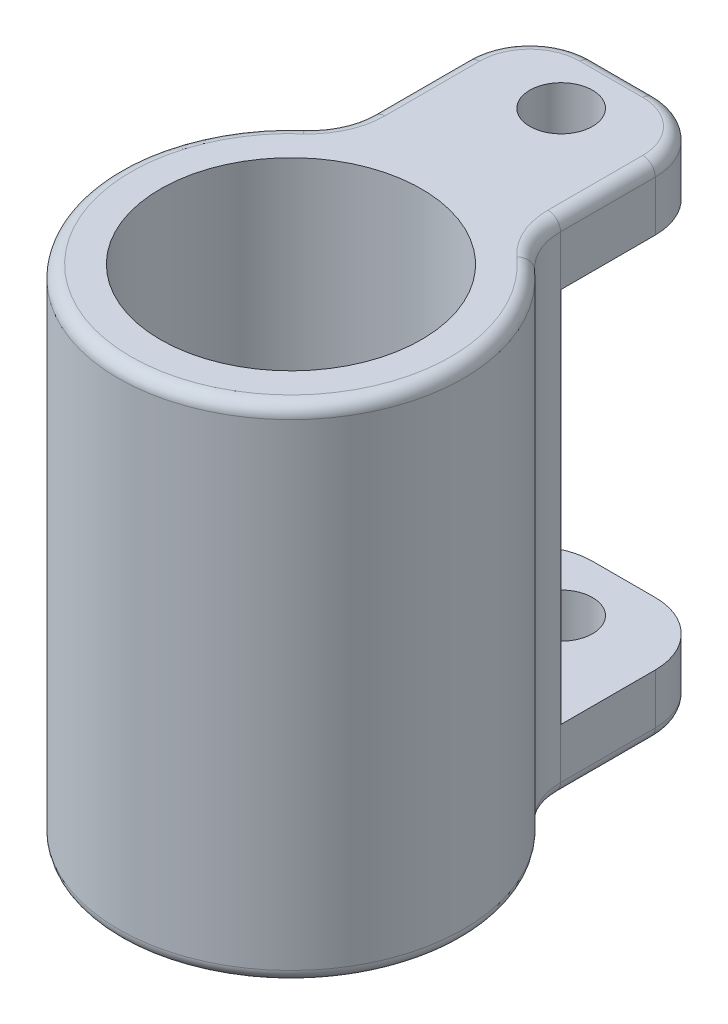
ISO-10303-21;
HEADER;
FILE_DESCRIPTION(('STEP AP214'),'2;1');
FILE_NAME('part.step','',(''),(''),'','','');
FILE_SCHEMA(('AUTOMOTIVE_DESIGN { 1 0 10303 214 1 1 1 1 }'));
ENDSEC;
DATA;
#1=APPLICATION_CONTEXT('core data for automotive mechanical design processes');
#2=APPLICATION_PROTOCOL_DEFINITION('international standard','automotive_design',2000,#1);
#3=PRODUCT_CONTEXT('',#1,'mechanical');
#4=PRODUCT('Part','Part','',(#3));
#5=PRODUCT_RELATED_PRODUCT_CATEGORY('part','',(#4));
#6=PRODUCT_DEFINITION_FORMATION('','',#4);
#7=PRODUCT_DEFINITION_CONTEXT('part definition',#1,'design');
#8=PRODUCT_DEFINITION('design','',#6,#7);
#9=PRODUCT_DEFINITION_SHAPE('','',#8);
#10=(LENGTH_UNIT() NAMED_UNIT(*) SI_UNIT(.MILLI.,.METRE.));
#11=(NAMED_UNIT(*) PLANE_ANGLE_UNIT() SI_UNIT($,.RADIAN.));
#12=(NAMED_UNIT(*) SI_UNIT($,.STERADIAN.) SOLID_ANGLE_UNIT());
#13=UNCERTAINTY_MEASURE_WITH_UNIT(LENGTH_MEASURE(1.E-05),#10,'distance_accuracy_value','');
#14=(GEOMETRIC_REPRESENTATION_CONTEXT(3) GLOBAL_UNCERTAINTY_ASSIGNED_CONTEXT((#13)) GLOBAL_UNIT_ASSIGNED_CONTEXT((#10,
#11,#12)) REPRESENTATION_CONTEXT('',''));
#15=CARTESIAN_POINT('',(0.,0.,0.));
#16=DIRECTION('',(0.,0.,1.));
#17=DIRECTION('',(1.,0.,0.));
#18=AXIS2_PLACEMENT_3D('',#15,#16,#17);
#19=CARTESIAN_POINT('',(1.5875,25.4,-13.6680134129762));
#20=DIRECTION('',(0.,-1.,0.));
#21=DIRECTION('',(0.,0.,-1.));
#22=AXIS2_PLACEMENT_3D('',#19,#20,#21);
#23=CYLINDRICAL_SURFACE('',#22,3.175);
#24=DIRECTION('',(0.,-1.,0.));
#25=VECTOR('',#24,1.);
#26=CARTESIAN_POINT('',(4.7625,25.4,-13.6680134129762));
#27=LINE('',#26,#25);
#28=CARTESIAN_POINT('',(4.7625,3.175,-13.6680134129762));
#29=VERTEX_POINT('',#28);
#30=CARTESIAN_POINT('',(4.7625,0.635,-13.6680134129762));
#31=VERTEX_POINT('',#30);
#32=EDGE_CURVE('E250',#29,#31,#27,.T.);
#33=ORIENTED_EDGE('',*,*,#32,.T.);
#34=CARTESIAN_POINT('',(1.5875,0.635,-13.6680134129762));
#35=DIRECTION('',(0.,1.,0.));
#36=DIRECTION('',(0.,0.,1.));
#37=AXIS2_PLACEMENT_3D('',#34,#35,#36);
#38=CIRCLE('',#37,3.175);
#39=CARTESIAN_POINT('',(1.58749999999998,0.635,-16.8430134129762));
#40=VERTEX_POINT('',#39);
#41=EDGE_CURVE('E304',#31,#40,#38,.T.);
#42=ORIENTED_EDGE('',*,*,#41,.T.);
#43=DIRECTION('',(0.,-1.,0.));
#44=VECTOR('',#43,1.);
#45=CARTESIAN_POINT('',(1.58749999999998,25.4,-16.8430134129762));
#46=LINE('',#45,#44);
#47=CARTESIAN_POINT('',(1.58749999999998,3.175,-16.8430134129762));
#48=VERTEX_POINT('',#47);
#49=EDGE_CURVE('E196',#48,#40,#46,.T.);
#50=ORIENTED_EDGE('',*,*,#49,.F.);
#51=CARTESIAN_POINT('',(1.5875,3.175,-13.6680134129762));
#52=DIRECTION('',(0.,-1.,0.));
#53=DIRECTION('',(0.,0.,-1.));
#54=AXIS2_PLACEMENT_3D('',#51,#52,#53);
#55=CIRCLE('',#54,3.175);
#56=EDGE_CURVE('E214',#29,#48,#55,.F.);
#57=ORIENTED_EDGE('',*,*,#56,.F.);
#58=EDGE_LOOP('',(#33,#42,#50,#57));
#59=FACE_BOUND('',#58,.T.);
#60=ADVANCED_FACE('F35',(#59),#23,.T.);
#61=CARTESIAN_POINT('',(1.58749999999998,25.4,-16.8430134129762));
#62=DIRECTION('',(0.,0.,1.));
#63=DIRECTION('',(1.,0.,0.));
#64=AXIS2_PLACEMENT_3D('',#61,#62,#63);
#65=PLANE('',#64);
#66=ORIENTED_EDGE('',*,*,#49,.T.);
#67=DIRECTION('',(-1.,0.,0.));
#68=VECTOR('',#67,1.);
#69=CARTESIAN_POINT('',(1.58749999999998,0.635,-16.8430134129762));
#70=LINE('',#69,#68);
#71=CARTESIAN_POINT('',(-1.58749999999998,0.635,-16.8430134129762));
#72=VERTEX_POINT('',#71);
#73=EDGE_CURVE('E302',#40,#72,#70,.T.);
#74=ORIENTED_EDGE('',*,*,#73,.T.);
#75=DIRECTION('',(0.,-1.,0.));
#76=VECTOR('',#75,1.);
#77=CARTESIAN_POINT('',(-1.58749999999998,25.4,-16.8430134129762));
#78=LINE('',#77,#76);
#79=CARTESIAN_POINT('',(-1.5875,3.175,-16.8430134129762));
#80=VERTEX_POINT('',#79);
#81=EDGE_CURVE('E257',#80,#72,#78,.T.);
#82=ORIENTED_EDGE('',*,*,#81,.F.);
#83=DIRECTION('',(1.,0.,0.));
#84=VECTOR('',#83,1.);
#85=CARTESIAN_POINT('',(-8.73225,3.175,-16.8430134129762));
#86=LINE('',#85,#84);
#87=EDGE_CURVE('E237',#80,#48,#86,.T.);
#88=ORIENTED_EDGE('',*,*,#87,.T.);
#89=EDGE_LOOP('',(#66,#74,#82,#88));
#90=FACE_BOUND('',#89,.T.);
#91=ADVANCED_FACE('F453',(#90),#65,.F.);
#92=CARTESIAN_POINT('',(-1.5875,25.4,-13.6680134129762));
#93=DIRECTION('',(0.,-1.,0.));
#94=DIRECTION('',(0.,0.,-1.));
#95=AXIS2_PLACEMENT_3D('',#92,#93,#94);
#96=CYLINDRICAL_SURFACE('',#95,3.175);
#97=ORIENTED_EDGE('',*,*,#81,.T.);
#98=CARTESIAN_POINT('',(-1.5875,0.635,-13.6680134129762));
#99=DIRECTION('',(0.,1.,0.));
#100=DIRECTION('',(0.,0.,1.));
#101=AXIS2_PLACEMENT_3D('',#98,#99,#100);
#102=CIRCLE('',#101,3.175);
#103=CARTESIAN_POINT('',(-4.7625,0.635,-13.6680134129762));
#104=VERTEX_POINT('',#103);
#105=EDGE_CURVE('E300',#72,#104,#102,.T.);
#106=ORIENTED_EDGE('',*,*,#105,.T.);
#107=DIRECTION('',(0.,-1.,0.));
#108=VECTOR('',#107,1.);
#109=CARTESIAN_POINT('',(-4.7625,25.4,-13.6680134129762));
#110=LINE('',#109,#108);
#111=CARTESIAN_POINT('',(-4.7625,3.175,-13.6680134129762));
#112=VERTEX_POINT('',#111);
#113=EDGE_CURVE('E254',#112,#104,#110,.T.);
#114=ORIENTED_EDGE('',*,*,#113,.F.);
#115=CARTESIAN_POINT('',(-1.5875,3.175,-13.6680134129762));
#116=DIRECTION('',(0.,-1.,0.));
#117=DIRECTION('',(0.,0.,-1.));
#118=AXIS2_PLACEMENT_3D('',#115,#116,#117);
#119=CIRCLE('',#118,3.175);
#120=EDGE_CURVE('E229',#80,#112,#119,.F.);
#121=ORIENTED_EDGE('',*,*,#120,.F.);
#122=EDGE_LOOP('',(#97,#106,#114,#121));
#123=FACE_BOUND('',#122,.T.);
#124=ADVANCED_FACE('F456',(#123),#96,.T.);
#125=CARTESIAN_POINT('',(1.5875,25.4,-13.6680134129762));
#126=DIRECTION('',(0.,1.,0.));
#127=DIRECTION('',(0.,0.,1.));
#128=AXIS2_PLACEMENT_3D('',#125,#126,#127);
#129=PLANE('',#128);
#130=CARTESIAN_POINT('',(1.5875,25.4,-13.6680134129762));
#131=DIRECTION('',(0.,1.,0.));
#132=DIRECTION('',(0.,0.,1.));
#133=AXIS2_PLACEMENT_3D('',#130,#131,#132);
#134=CIRCLE('',#133,2.54);
#135=CARTESIAN_POINT('',(4.1275,25.4,-13.6680134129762));
#136=VERTEX_POINT('',#135);
#137=CARTESIAN_POINT('',(1.58749999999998,25.4,-16.2080134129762));
#138=VERTEX_POINT('',#137);
#139=EDGE_CURVE('E326',#136,#138,#134,.T.);
#140=ORIENTED_EDGE('',*,*,#139,.T.);
#141=DIRECTION('',(-1.,0.,0.));
#142=VECTOR('',#141,1.);
#143=CARTESIAN_POINT('',(-1.58749999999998,25.4,-16.2080134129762));
#144=LINE('',#143,#142);
#145=CARTESIAN_POINT('',(-1.58749999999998,25.4,-16.2080134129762));
#146=VERTEX_POINT('',#145);
#147=EDGE_CURVE('E328',#138,#146,#144,.T.);
#148=ORIENTED_EDGE('',*,*,#147,.T.);
#149=CARTESIAN_POINT('',(-1.5875,25.4,-13.6680134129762));
#150=DIRECTION('',(0.,1.,0.));
#151=DIRECTION('',(0.,0.,1.));
#152=AXIS2_PLACEMENT_3D('',#149,#150,#151);
#153=CIRCLE('',#152,2.54);
#154=CARTESIAN_POINT('',(-4.1275,25.4,-13.6680134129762));
#155=VERTEX_POINT('',#154);
#156=EDGE_CURVE('E314',#146,#155,#153,.T.);
#157=ORIENTED_EDGE('',*,*,#156,.T.);
#158=DIRECTION('',(0.,0.,1.));
#159=VECTOR('',#158,1.);
#160=CARTESIAN_POINT('',(-4.1275,25.4,-8.87439478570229));
#161=LINE('',#160,#159);
#162=CARTESIAN_POINT('',(-4.1275,25.4,-8.87439478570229));
#163=VERTEX_POINT('',#162);
#164=EDGE_CURVE('E316',#155,#163,#161,.T.);
#165=ORIENTED_EDGE('',*,*,#164,.T.);
#166=CARTESIAN_POINT('',(-7.9375,25.4,-8.87439478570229));
#167=DIRECTION('',(0.,1.,0.));
#168=DIRECTION('',(0.,0.,1.));
#169=AXIS2_PLACEMENT_3D('',#166,#167,#168);
#170=CIRCLE('',#169,3.81);
#171=CARTESIAN_POINT('',(-5.3975,25.4,-6.03458845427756));
#172=VERTEX_POINT('',#171);
#173=EDGE_CURVE('E318',#163,#172,#170,.F.);
#174=ORIENTED_EDGE('',*,*,#173,.T.);
#175=CARTESIAN_POINT('',(0.,25.4,0.));
#176=DIRECTION('',(0.,1.,0.));
#177=DIRECTION('',(0.,0.,1.));
#178=AXIS2_PLACEMENT_3D('',#175,#176,#177);
#179=CIRCLE('',#178,8.09625);
#180=CARTESIAN_POINT('',(5.3975,25.4,-6.03458845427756));
#181=VERTEX_POINT('',#180);
#182=EDGE_CURVE('E320',#172,#181,#179,.T.);
#183=ORIENTED_EDGE('',*,*,#182,.T.);
#184=CARTESIAN_POINT('',(7.9375,25.4,-8.87439478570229));
#185=DIRECTION('',(0.,1.,0.));
#186=DIRECTION('',(0.,0.,1.));
#187=AXIS2_PLACEMENT_3D('',#184,#185,#186);
#188=CIRCLE('',#187,3.81);
#189=CARTESIAN_POINT('',(4.1275,25.4,-8.87439478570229));
#190=VERTEX_POINT('',#189);
#191=EDGE_CURVE('E322',#181,#190,#188,.F.);
#192=ORIENTED_EDGE('',*,*,#191,.T.);
#193=DIRECTION('',(0.,0.,-1.));
#194=VECTOR('',#193,1.);
#195=CARTESIAN_POINT('',(4.1275,25.4,-13.6680134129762));
#196=LINE('',#195,#194);
#197=EDGE_CURVE('E324',#190,#136,#196,.T.);
#198=ORIENTED_EDGE('',*,*,#197,.T.);
#199=EDGE_LOOP('',(#140,#148,#157,#165,#174,#183,#192,#198));
#200=FACE_BOUND('',#199,.T.);
#201=CARTESIAN_POINT('',(0.,25.4,-13.6680134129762));
#202=DIRECTION('',(0.,1.,0.));
#203=DIRECTION('',(0.,0.,1.));
#204=AXIS2_PLACEMENT_3D('',#201,#202,#203);
#205=CIRCLE('',#204,1.5875);
#206=CARTESIAN_POINT('',(0.,25.4,-12.0805134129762));
#207=VERTEX_POINT('',#206);
#208=EDGE_CURVE('E359',#207,#207,#205,.T.);
#209=ORIENTED_EDGE('',*,*,#208,.F.);
#210=EDGE_LOOP('',(#209));
#211=FACE_BOUND('',#210,.T.);
#212=CARTESIAN_POINT('',(0.,25.4,0.));
#213=DIRECTION('',(0.,1.,0.));
#214=DIRECTION('',(0.,0.,1.));
#215=AXIS2_PLACEMENT_3D('',#212,#213,#214);
#216=CIRCLE('',#215,6.604);
#217=CARTESIAN_POINT('',(0.,25.4,6.604));
#218=VERTEX_POINT('',#217);
#219=EDGE_CURVE('E247',#218,#218,#216,.T.);
#220=ORIENTED_EDGE('',*,*,#219,.F.);
#221=EDGE_LOOP('',(#220));
#222=FACE_BOUND('',#221,.T.);
#223=ADVANCED_FACE('F479',(#200,#211,#222),#129,.T.);
#224=CARTESIAN_POINT('',(1.5875,0.,-13.6680134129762));
#225=DIRECTION('',(0.,1.,0.));
#226=DIRECTION('',(0.,0.,1.));
#227=AXIS2_PLACEMENT_3D('',#224,#225,#226);
#228=PLANE('',#227);
#229=CARTESIAN_POINT('',(0.,0.,0.));
#230=DIRECTION('',(0.,1.,0.));
#231=DIRECTION('',(0.,0.,1.));
#232=AXIS2_PLACEMENT_3D('',#229,#230,#231);
#233=CIRCLE('',#232,8.09625);
#234=CARTESIAN_POINT('',(5.3975,0.,-6.03458845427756));
#235=VERTEX_POINT('',#234);
#236=CARTESIAN_POINT('',(-5.3975,0.,-6.03458845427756));
#237=VERTEX_POINT('',#236);
#238=EDGE_CURVE('E271',#235,#237,#233,.F.);
#239=ORIENTED_EDGE('',*,*,#238,.T.);
#240=CARTESIAN_POINT('',(-7.9375,0.,-8.87439478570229));
#241=DIRECTION('',(0.,1.,0.));
#242=DIRECTION('',(0.,0.,1.));
#243=AXIS2_PLACEMENT_3D('',#240,#241,#242);
#244=CIRCLE('',#243,3.81);
#245=CARTESIAN_POINT('',(-4.1275,0.,-8.87439478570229));
#246=VERTEX_POINT('',#245);
#247=EDGE_CURVE('E288',#237,#246,#244,.T.);
#248=ORIENTED_EDGE('',*,*,#247,.T.);
#249=DIRECTION('',(0.,0.,1.));
#250=VECTOR('',#249,1.);
#251=CARTESIAN_POINT('',(-4.1275,0.,-13.6680134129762));
#252=LINE('',#251,#250);
#253=CARTESIAN_POINT('',(-4.1275,0.,-13.6680134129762));
#254=VERTEX_POINT('',#253);
#255=EDGE_CURVE('E286',#246,#254,#252,.F.);
#256=ORIENTED_EDGE('',*,*,#255,.T.);
#257=CARTESIAN_POINT('',(-1.5875,0.,-13.6680134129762));
#258=DIRECTION('',(0.,1.,0.));
#259=DIRECTION('',(0.,0.,1.));
#260=AXIS2_PLACEMENT_3D('',#257,#258,#259);
#261=CIRCLE('',#260,2.54);
#262=CARTESIAN_POINT('',(-1.58749999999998,0.,-16.2080134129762));
#263=VERTEX_POINT('',#262);
#264=EDGE_CURVE('E284',#254,#263,#261,.F.);
#265=ORIENTED_EDGE('',*,*,#264,.T.);
#266=DIRECTION('',(-1.,0.,0.));
#267=VECTOR('',#266,1.);
#268=CARTESIAN_POINT('',(1.5875,0.,-16.2080134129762));
#269=LINE('',#268,#267);
#270=CARTESIAN_POINT('',(1.58749999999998,0.,-16.2080134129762));
#271=VERTEX_POINT('',#270);
#272=EDGE_CURVE('E282',#263,#271,#269,.F.);
#273=ORIENTED_EDGE('',*,*,#272,.T.);
#274=CARTESIAN_POINT('',(1.5875,0.,-13.6680134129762));
#275=DIRECTION('',(0.,1.,0.));
#276=DIRECTION('',(0.,0.,1.));
#277=AXIS2_PLACEMENT_3D('',#274,#275,#276);
#278=CIRCLE('',#277,2.54);
#279=CARTESIAN_POINT('',(4.1275,0.,-13.6680134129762));
#280=VERTEX_POINT('',#279);
#281=EDGE_CURVE('E280',#271,#280,#278,.F.);
#282=ORIENTED_EDGE('',*,*,#281,.T.);
#283=DIRECTION('',(0.,0.,-1.));
#284=VECTOR('',#283,1.);
#285=CARTESIAN_POINT('',(4.1275,0.,-13.6680134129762));
#286=LINE('',#285,#284);
#287=CARTESIAN_POINT('',(4.1275,0.,-8.87439478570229));
#288=VERTEX_POINT('',#287);
#289=EDGE_CURVE('E278',#280,#288,#286,.F.);
#290=ORIENTED_EDGE('',*,*,#289,.T.);
#291=CARTESIAN_POINT('',(7.9375,0.,-8.87439478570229));
#292=DIRECTION('',(0.,1.,0.));
#293=DIRECTION('',(0.,0.,1.));
#294=AXIS2_PLACEMENT_3D('',#291,#292,#293);
#295=CIRCLE('',#294,3.81);
#296=EDGE_CURVE('E276',#288,#235,#295,.T.);
#297=ORIENTED_EDGE('',*,*,#296,.T.);
#298=EDGE_LOOP('',(#239,#248,#256,#265,#273,#282,#290,#297));
#299=FACE_BOUND('',#298,.T.);
#300=CARTESIAN_POINT('',(0.,0.,-13.6680134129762));
#301=DIRECTION('',(0.,1.,0.));
#302=DIRECTION('',(0.,0.,1.));
#303=AXIS2_PLACEMENT_3D('',#300,#301,#302);
#304=CIRCLE('',#303,1.5875);
#305=CARTESIAN_POINT('',(0.,0.,-12.0805134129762));
#306=VERTEX_POINT('',#305);
#307=EDGE_CURVE('E274',#306,#306,#304,.T.);
#308=ORIENTED_EDGE('',*,*,#307,.T.);
#309=EDGE_LOOP('',(#308));
#310=FACE_BOUND('',#309,.T.);
#311=CARTESIAN_POINT('',(0.,0.,0.));
#312=DIRECTION('',(0.,1.,0.));
#313=DIRECTION('',(0.,0.,1.));
#314=AXIS2_PLACEMENT_3D('',#311,#312,#313);
#315=CIRCLE('',#314,6.604);
#316=CARTESIAN_POINT('',(0.,0.,6.604));
#317=VERTEX_POINT('',#316);
#318=EDGE_CURVE('E246',#317,#317,#315,.T.);
#319=ORIENTED_EDGE('',*,*,#318,.T.);
#320=EDGE_LOOP('',(#319));
#321=FACE_BOUND('',#320,.T.);
#322=ADVANCED_FACE('F411',(#299,#310,#321),#228,.F.);
#323=CARTESIAN_POINT('',(1.58749999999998,24.765,-16.8430134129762));
#324=VERTEX_POINT('',#323);
#325=CARTESIAN_POINT('',(1.58749999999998,22.225,-16.8430134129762));
#326=VERTEX_POINT('',#325);
#327=EDGE_CURVE('E188',#324,#326,#46,.T.);
#328=ORIENTED_EDGE('',*,*,#327,.F.);
#329=CARTESIAN_POINT('',(1.5875,24.765,-13.6680134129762));
#330=DIRECTION('',(0.,1.,0.));
#331=DIRECTION('',(0.,0.,1.));
#332=AXIS2_PLACEMENT_3D('',#329,#330,#331);
#333=CIRCLE('',#332,3.175);
#334=CARTESIAN_POINT('',(4.7625,24.765,-13.6680134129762));
#335=VERTEX_POINT('',#334);
#336=EDGE_CURVE('E332',#324,#335,#333,.F.);
#337=ORIENTED_EDGE('',*,*,#336,.T.);
#338=CARTESIAN_POINT('',(4.7625,22.225,-13.6680134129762));
#339=VERTEX_POINT('',#338);
#340=EDGE_CURVE('E213',#335,#339,#27,.T.);
#341=ORIENTED_EDGE('',*,*,#340,.T.);
#342=CARTESIAN_POINT('',(1.5875,22.225,-13.6680134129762));
#343=DIRECTION('',(0.,1.,0.));
#344=DIRECTION('',(0.,0.,1.));
#345=AXIS2_PLACEMENT_3D('',#342,#343,#344);
#346=CIRCLE('',#345,3.175);
#347=EDGE_CURVE('E203',#326,#339,#346,.F.);
#348=ORIENTED_EDGE('',*,*,#347,.F.);
#349=EDGE_LOOP('',(#328,#337,#341,#348));
#350=FACE_BOUND('',#349,.T.);
#351=ADVANCED_FACE('F211',(#350),#23,.T.);
#352=CARTESIAN_POINT('',(-1.58749999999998,24.765,-16.8430134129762));
#353=VERTEX_POINT('',#352);
#354=CARTESIAN_POINT('',(-1.5875,22.225,-16.8430134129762));
#355=VERTEX_POINT('',#354);
#356=EDGE_CURVE('E258',#353,#355,#78,.T.);
#357=ORIENTED_EDGE('',*,*,#356,.F.);
#358=DIRECTION('',(-1.,0.,0.));
#359=VECTOR('',#358,1.);
#360=CARTESIAN_POINT('',(1.58749999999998,24.765,-16.8430134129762));
#361=LINE('',#360,#359);
#362=EDGE_CURVE('E192',#353,#324,#361,.F.);
#363=ORIENTED_EDGE('',*,*,#362,.T.);
#364=ORIENTED_EDGE('',*,*,#327,.T.);
#365=DIRECTION('',(1.,0.,0.));
#366=VECTOR('',#365,1.);
#367=CARTESIAN_POINT('',(-8.73225,22.225,-16.8430134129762));
#368=LINE('',#367,#366);
#369=EDGE_CURVE('E191',#355,#326,#368,.T.);
#370=ORIENTED_EDGE('',*,*,#369,.F.);
#371=EDGE_LOOP('',(#357,#363,#364,#370));
#372=FACE_BOUND('',#371,.T.);
#373=ADVANCED_FACE('F190',(#372),#65,.F.);
#374=CARTESIAN_POINT('',(-4.7625,24.765,-13.6680134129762));
#375=VERTEX_POINT('',#374);
#376=CARTESIAN_POINT('',(-4.7625,22.225,-13.6680134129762));
#377=VERTEX_POINT('',#376);
#378=EDGE_CURVE('E255',#375,#377,#110,.T.);
#379=ORIENTED_EDGE('',*,*,#378,.F.);
#380=CARTESIAN_POINT('',(-1.5875,24.765,-13.6680134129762));
#381=DIRECTION('',(0.,1.,0.));
#382=DIRECTION('',(0.,0.,1.));
#383=AXIS2_PLACEMENT_3D('',#380,#381,#382);
#384=CIRCLE('',#383,3.175);
#385=EDGE_CURVE('E11',#375,#353,#384,.F.);
#386=ORIENTED_EDGE('',*,*,#385,.T.);
#387=ORIENTED_EDGE('',*,*,#356,.T.);
#388=CARTESIAN_POINT('',(-1.5875,22.225,-13.6680134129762));
#389=DIRECTION('',(0.,1.,0.));
#390=DIRECTION('',(0.,0.,1.));
#391=AXIS2_PLACEMENT_3D('',#388,#389,#390);
#392=CIRCLE('',#391,3.175);
#393=EDGE_CURVE('E207',#377,#355,#392,.F.);
#394=ORIENTED_EDGE('',*,*,#393,.F.);
#395=EDGE_LOOP('',(#379,#386,#387,#394));
#396=FACE_BOUND('',#395,.T.);
#397=ADVANCED_FACE('F470',(#396),#96,.T.);
#398=CARTESIAN_POINT('',(-4.7625,25.4,-7.31801341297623));
#399=DIRECTION('',(1.,0.,0.));
#400=DIRECTION('',(0.,0.,-1.));
#401=AXIS2_PLACEMENT_3D('',#398,#399,#400);
#402=PLANE('',#401);
#403=ORIENTED_EDGE('',*,*,#113,.T.);
#404=DIRECTION('',(0.,0.,1.));
#405=VECTOR('',#404,1.);
#406=CARTESIAN_POINT('',(-4.7625,0.635,-7.31801341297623));
#407=LINE('',#406,#405);
#408=CARTESIAN_POINT('',(-4.7625,0.635,-8.87439478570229));
#409=VERTEX_POINT('',#408);
#410=EDGE_CURVE('E298',#104,#409,#407,.T.);
#411=ORIENTED_EDGE('',*,*,#410,.T.);
#412=DIRECTION('',(0.,1.,0.));
#413=VECTOR('',#412,1.);
#414=CARTESIAN_POINT('',(-4.7625,25.4,-8.87439478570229));
#415=LINE('',#414,#413);
#416=CARTESIAN_POINT('',(-4.7625,24.765,-8.87439478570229));
#417=VERTEX_POINT('',#416);
#418=EDGE_CURVE('E268',#409,#417,#415,.T.);
#419=ORIENTED_EDGE('',*,*,#418,.T.);
#420=DIRECTION('',(0.,0.,1.));
#421=VECTOR('',#420,1.);
#422=CARTESIAN_POINT('',(-4.7625,24.765,-13.6680134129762));
#423=LINE('',#422,#421);
#424=EDGE_CURVE('E296',#417,#375,#423,.F.);
#425=ORIENTED_EDGE('',*,*,#424,.T.);
#426=ORIENTED_EDGE('',*,*,#378,.T.);
#427=DIRECTION('',(0.,0.,-1.));
#428=VECTOR('',#427,1.);
#429=CARTESIAN_POINT('',(-4.7625,22.225,-16.8430134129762));
#430=LINE('',#429,#428);
#431=CARTESIAN_POINT('',(-4.7625,22.225,-8.90551341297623));
#432=VERTEX_POINT('',#431);
#433=EDGE_CURVE('E240',#432,#377,#430,.T.);
#434=ORIENTED_EDGE('',*,*,#433,.F.);
#435=DIRECTION('',(0.,1.,0.));
#436=VECTOR('',#435,1.);
#437=CARTESIAN_POINT('',(-4.7625,22.225,-8.90551341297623));
#438=LINE('',#437,#436);
#439=CARTESIAN_POINT('',(-4.7625,3.175,-8.90551341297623));
#440=VERTEX_POINT('',#439);
#441=EDGE_CURVE('E217',#440,#432,#438,.T.);
#442=ORIENTED_EDGE('',*,*,#441,.F.);
#443=DIRECTION('',(0.,0.,1.));
#444=VECTOR('',#443,1.);
#445=CARTESIAN_POINT('',(-4.7625,3.175,-16.8430134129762));
#446=LINE('',#445,#444);
#447=EDGE_CURVE('E226',#112,#440,#446,.T.);
#448=ORIENTED_EDGE('',*,*,#447,.F.);
#449=EDGE_LOOP('',(#403,#411,#419,#425,#426,#434,#442,#448));
#450=FACE_BOUND('',#449,.T.);
#451=ADVANCED_FACE('F464',(#450),#402,.F.);
#452=CARTESIAN_POINT('',(0.,25.4,0.));
#453=DIRECTION('',(0.,-1.,0.));
#454=DIRECTION('',(0.,0.,-1.));
#455=AXIS2_PLACEMENT_3D('',#452,#453,#454);
#456=CYLINDRICAL_SURFACE('',#455,8.73125);
#457=DIRECTION('',(0.,-1.,0.));
#458=VECTOR('',#457,1.);
#459=CARTESIAN_POINT('',(5.82083333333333,25.4,-6.50788950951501));
#460=LINE('',#459,#458);
#461=CARTESIAN_POINT('',(5.82083333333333,0.635,-6.50788950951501));
#462=VERTEX_POINT('',#461);
#463=CARTESIAN_POINT('',(5.82083333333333,24.765,-6.50788950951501));
#464=VERTEX_POINT('',#463);
#465=EDGE_CURVE('E265',#462,#464,#460,.F.);
#466=ORIENTED_EDGE('',*,*,#465,.T.);
#467=CARTESIAN_POINT('',(0.,24.765,0.));
#468=DIRECTION('',(0.,1.,0.));
#469=DIRECTION('',(0.,0.,1.));
#470=AXIS2_PLACEMENT_3D('',#467,#468,#469);
#471=CIRCLE('',#470,8.73125);
#472=CARTESIAN_POINT('',(-5.82083333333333,24.765,-6.50788950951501));
#473=VERTEX_POINT('',#472);
#474=EDGE_CURVE('E44',#464,#473,#471,.F.);
#475=ORIENTED_EDGE('',*,*,#474,.T.);
#476=DIRECTION('',(0.,-1.,0.));
#477=VECTOR('',#476,1.);
#478=CARTESIAN_POINT('',(-5.82083333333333,25.4,-6.50788950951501));
#479=LINE('',#478,#477);
#480=CARTESIAN_POINT('',(-5.82083333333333,0.635,-6.50788950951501));
#481=VERTEX_POINT('',#480);
#482=EDGE_CURVE('E262',#473,#481,#479,.T.);
#483=ORIENTED_EDGE('',*,*,#482,.T.);
#484=CARTESIAN_POINT('',(0.,0.635,0.));
#485=DIRECTION('',(0.,1.,0.));
#486=DIRECTION('',(0.,0.,1.));
#487=AXIS2_PLACEMENT_3D('',#484,#485,#486);
#488=CIRCLE('',#487,8.73125);
#489=EDGE_CURVE('E334',#481,#462,#488,.T.);
#490=ORIENTED_EDGE('',*,*,#489,.T.);
#491=EDGE_LOOP('',(#466,#475,#483,#490));
#492=FACE_BOUND('',#491,.T.);
#493=ADVANCED_FACE('F392',(#492),#456,.T.);
#494=CARTESIAN_POINT('',(4.7625,25.4,-7.31801341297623));
#495=DIRECTION('',(-1.,0.,0.));
#496=DIRECTION('',(0.,0.,1.));
#497=AXIS2_PLACEMENT_3D('',#494,#495,#496);
#498=PLANE('',#497);
#499=DIRECTION('',(0.,1.,0.));
#500=VECTOR('',#499,1.);
#501=CARTESIAN_POINT('',(4.7625,0.,-8.87439478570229));
#502=LINE('',#501,#500);
#503=CARTESIAN_POINT('',(4.7625,24.765,-8.87439478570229));
#504=VERTEX_POINT('',#503);
#505=CARTESIAN_POINT('',(4.7625,0.635,-8.87439478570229));
#506=VERTEX_POINT('',#505);
#507=EDGE_CURVE('E195',#504,#506,#502,.F.);
#508=ORIENTED_EDGE('',*,*,#507,.T.);
#509=DIRECTION('',(0.,0.,-1.));
#510=VECTOR('',#509,1.);
#511=CARTESIAN_POINT('',(4.7625,0.635,-7.31801341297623));
#512=LINE('',#511,#510);
#513=EDGE_CURVE('E308',#506,#31,#512,.T.);
#514=ORIENTED_EDGE('',*,*,#513,.T.);
#515=ORIENTED_EDGE('',*,*,#32,.F.);
#516=DIRECTION('',(0.,0.,-1.));
#517=VECTOR('',#516,1.);
#518=CARTESIAN_POINT('',(4.7625,3.175,-16.8430134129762));
#519=LINE('',#518,#517);
#520=CARTESIAN_POINT('',(4.7625,3.175,-8.90551341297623));
#521=VERTEX_POINT('',#520);
#522=EDGE_CURVE('E209',#521,#29,#519,.T.);
#523=ORIENTED_EDGE('',*,*,#522,.F.);
#524=DIRECTION('',(0.,-1.,0.));
#525=VECTOR('',#524,1.);
#526=CARTESIAN_POINT('',(4.7625,22.225,-8.90551341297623));
#527=LINE('',#526,#525);
#528=CARTESIAN_POINT('',(4.7625,22.225,-8.90551341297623));
#529=VERTEX_POINT('',#528);
#530=EDGE_CURVE('E233',#529,#521,#527,.T.);
#531=ORIENTED_EDGE('',*,*,#530,.F.);
#532=DIRECTION('',(0.,0.,1.));
#533=VECTOR('',#532,1.);
#534=CARTESIAN_POINT('',(4.7625,22.225,-16.8430134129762));
#535=LINE('',#534,#533);
#536=EDGE_CURVE('E231',#339,#529,#535,.T.);
#537=ORIENTED_EDGE('',*,*,#536,.F.);
#538=ORIENTED_EDGE('',*,*,#340,.F.);
#539=DIRECTION('',(0.,0.,-1.));
#540=VECTOR('',#539,1.);
#541=CARTESIAN_POINT('',(4.7625,24.765,-8.87439478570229));
#542=LINE('',#541,#540);
#543=EDGE_CURVE('E306',#335,#504,#542,.F.);
#544=ORIENTED_EDGE('',*,*,#543,.T.);
#545=EDGE_LOOP('',(#508,#514,#515,#523,#531,#537,#538,#544));
#546=FACE_BOUND('',#545,.T.);
#547=ADVANCED_FACE('F433',(#546),#498,.F.);
#548=CARTESIAN_POINT('',(0.,25.4,0.));
#549=DIRECTION('',(0.,-1.,0.));
#550=DIRECTION('',(0.,0.,-1.));
#551=AXIS2_PLACEMENT_3D('',#548,#549,#550);
#552=CYLINDRICAL_SURFACE('',#551,6.604);
#553=ORIENTED_EDGE('',*,*,#219,.T.);
#554=EDGE_LOOP('',(#553));
#555=FACE_BOUND('',#554,.T.);
#556=ORIENTED_EDGE('',*,*,#318,.F.);
#557=EDGE_LOOP('',(#556));
#558=FACE_BOUND('',#557,.T.);
#559=ADVANCED_FACE('F520',(#555,#558),#552,.F.);
#560=CARTESIAN_POINT('',(-8.73225,3.175,-16.8430134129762));
#561=DIRECTION('',(0.,-1.,0.));
#562=DIRECTION('',(0.,0.,-1.));
#563=AXIS2_PLACEMENT_3D('',#560,#561,#562);
#564=PLANE('',#563);
#565=CARTESIAN_POINT('',(0.,3.175,-13.6680134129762));
#566=DIRECTION('',(0.,-1.,0.));
#567=DIRECTION('',(0.,0.,-1.));
#568=AXIS2_PLACEMENT_3D('',#565,#566,#567);
#569=CIRCLE('',#568,1.5875);
#570=CARTESIAN_POINT('',(0.,3.175,-15.2555134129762));
#571=VERTEX_POINT('',#570);
#572=EDGE_CURVE('E220',#571,#571,#569,.T.);
#573=ORIENTED_EDGE('',*,*,#572,.T.);
#574=EDGE_LOOP('',(#573));
#575=FACE_BOUND('',#574,.T.);
#576=ORIENTED_EDGE('',*,*,#56,.T.);
#577=ORIENTED_EDGE('',*,*,#87,.F.);
#578=ORIENTED_EDGE('',*,*,#120,.T.);
#579=ORIENTED_EDGE('',*,*,#447,.T.);
#580=DIRECTION('',(1.,0.,0.));
#581=VECTOR('',#580,1.);
#582=CARTESIAN_POINT('',(-8.73225,3.175,-8.90551341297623));
#583=LINE('',#582,#581);
#584=EDGE_CURVE('E241',#440,#521,#583,.T.);
#585=ORIENTED_EDGE('',*,*,#584,.T.);
#586=ORIENTED_EDGE('',*,*,#522,.T.);
#587=EDGE_LOOP('',(#576,#577,#578,#579,#585,#586));
#588=FACE_BOUND('',#587,.T.);
#589=ADVANCED_FACE('F461',(#575,#588),#564,.F.);
#590=CARTESIAN_POINT('',(-8.73225,22.225,-8.90551341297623));
#591=DIRECTION('',(0.,0.,1.));
#592=DIRECTION('',(0.,-1.,0.));
#593=AXIS2_PLACEMENT_3D('',#590,#591,#592);
#594=PLANE('',#593);
#595=ORIENTED_EDGE('',*,*,#441,.T.);
#596=DIRECTION('',(1.,0.,0.));
#597=VECTOR('',#596,1.);
#598=CARTESIAN_POINT('',(-8.73225,22.225,-8.90551341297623));
#599=LINE('',#598,#597);
#600=EDGE_CURVE('E208',#432,#529,#599,.T.);
#601=ORIENTED_EDGE('',*,*,#600,.T.);
#602=ORIENTED_EDGE('',*,*,#530,.T.);
#603=ORIENTED_EDGE('',*,*,#584,.F.);
#604=EDGE_LOOP('',(#595,#601,#602,#603));
#605=FACE_BOUND('',#604,.T.);
#606=ADVANCED_FACE('F467',(#605),#594,.F.);
#607=CARTESIAN_POINT('',(-8.73225,22.225,-16.8430134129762));
#608=DIRECTION('',(0.,1.,0.));
#609=DIRECTION('',(0.,0.,1.));
#610=AXIS2_PLACEMENT_3D('',#607,#608,#609);
#611=PLANE('',#610);
#612=CARTESIAN_POINT('',(0.,22.225,-13.6680134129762));
#613=DIRECTION('',(0.,1.,0.));
#614=DIRECTION('',(0.,0.,1.));
#615=AXIS2_PLACEMENT_3D('',#612,#613,#614);
#616=CIRCLE('',#615,1.5875);
#617=CARTESIAN_POINT('',(0.,22.225,-12.0805134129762));
#618=VERTEX_POINT('',#617);
#619=EDGE_CURVE('E215',#618,#618,#616,.T.);
#620=ORIENTED_EDGE('',*,*,#619,.T.);
#621=EDGE_LOOP('',(#620));
#622=FACE_BOUND('',#621,.T.);
#623=ORIENTED_EDGE('',*,*,#347,.T.);
#624=ORIENTED_EDGE('',*,*,#536,.T.);
#625=ORIENTED_EDGE('',*,*,#600,.F.);
#626=ORIENTED_EDGE('',*,*,#433,.T.);
#627=ORIENTED_EDGE('',*,*,#393,.T.);
#628=ORIENTED_EDGE('',*,*,#369,.T.);
#629=EDGE_LOOP('',(#623,#624,#625,#626,#627,#628));
#630=FACE_BOUND('',#629,.T.);
#631=ADVANCED_FACE('F201',(#622,#630),#611,.F.);
#632=CARTESIAN_POINT('',(7.9375,25.4,-8.87439478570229));
#633=DIRECTION('',(0.,-1.,0.));
#634=DIRECTION('',(0.,0.,-1.));
#635=AXIS2_PLACEMENT_3D('',#632,#633,#634);
#636=CYLINDRICAL_SURFACE('',#635,3.175);
#637=ORIENTED_EDGE('',*,*,#465,.F.);
#638=CARTESIAN_POINT('',(7.9375,0.635,-8.87439478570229));
#639=DIRECTION('',(0.,1.,0.));
#640=DIRECTION('',(0.,0.,1.));
#641=AXIS2_PLACEMENT_3D('',#638,#639,#640);
#642=CIRCLE('',#641,3.175);
#643=EDGE_CURVE('E312',#462,#506,#642,.F.);
#644=ORIENTED_EDGE('',*,*,#643,.T.);
#645=ORIENTED_EDGE('',*,*,#507,.F.);
#646=CARTESIAN_POINT('',(7.9375,24.765,-8.87439478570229));
#647=DIRECTION('',(0.,1.,0.));
#648=DIRECTION('',(0.,0.,1.));
#649=AXIS2_PLACEMENT_3D('',#646,#647,#648);
#650=CIRCLE('',#649,3.175);
#651=EDGE_CURVE('E310',#504,#464,#650,.T.);
#652=ORIENTED_EDGE('',*,*,#651,.T.);
#653=EDGE_LOOP('',(#637,#644,#645,#652));
#654=FACE_BOUND('',#653,.T.);
#655=ADVANCED_FACE('F420',(#654),#636,.F.);
#656=CARTESIAN_POINT('',(-7.9375,25.4,-8.87439478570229));
#657=DIRECTION('',(0.,-1.,0.));
#658=DIRECTION('',(0.,0.,-1.));
#659=AXIS2_PLACEMENT_3D('',#656,#657,#658);
#660=CYLINDRICAL_SURFACE('',#659,3.175);
#661=ORIENTED_EDGE('',*,*,#418,.F.);
#662=CARTESIAN_POINT('',(-7.9375,0.635,-8.87439478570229));
#663=DIRECTION('',(0.,1.,0.));
#664=DIRECTION('',(0.,0.,1.));
#665=AXIS2_PLACEMENT_3D('',#662,#663,#664);
#666=CIRCLE('',#665,3.175);
#667=EDGE_CURVE('E293',#409,#481,#666,.F.);
#668=ORIENTED_EDGE('',*,*,#667,.T.);
#669=ORIENTED_EDGE('',*,*,#482,.F.);
#670=CARTESIAN_POINT('',(-7.9375,24.765,-8.87439478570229));
#671=DIRECTION('',(0.,1.,0.));
#672=DIRECTION('',(0.,0.,1.));
#673=AXIS2_PLACEMENT_3D('',#670,#671,#672);
#674=CIRCLE('',#673,3.175);
#675=EDGE_CURVE('E291',#473,#417,#674,.T.);
#676=ORIENTED_EDGE('',*,*,#675,.T.);
#677=EDGE_LOOP('',(#661,#668,#669,#676));
#678=FACE_BOUND('',#677,.T.);
#679=ADVANCED_FACE('F396',(#678),#660,.F.);
#680=CARTESIAN_POINT('',(0.,25.4,-13.6680134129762));
#681=DIRECTION('',(0.,1.,0.));
#682=DIRECTION('',(0.,0.,1.));
#683=AXIS2_PLACEMENT_3D('',#680,#681,#682);
#684=CYLINDRICAL_SURFACE('',#683,1.5875);
#685=ORIENTED_EDGE('',*,*,#307,.F.);
#686=EDGE_LOOP('',(#685));
#687=FACE_BOUND('',#686,.T.);
#688=ORIENTED_EDGE('',*,*,#572,.F.);
#689=EDGE_LOOP('',(#688));
#690=FACE_BOUND('',#689,.T.);
#691=ADVANCED_FACE('F593',(#687,#690),#684,.F.);
#692=ORIENTED_EDGE('',*,*,#208,.T.);
#693=EDGE_LOOP('',(#692));
#694=FACE_BOUND('',#693,.T.);
#695=ORIENTED_EDGE('',*,*,#619,.F.);
#696=EDGE_LOOP('',(#695));
#697=FACE_BOUND('',#696,.T.);
#698=ADVANCED_FACE('F604',(#694,#697),#684,.F.);
#699=CARTESIAN_POINT('',(1.5875,0.635,-13.6680134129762));
#700=DIRECTION('',(0.,1.,0.));
#701=DIRECTION('',(0.,0.,1.));
#702=AXIS2_PLACEMENT_3D('',#699,#700,#701);
#703=TOROIDAL_SURFACE('',#702,2.54,0.635);
#704=CARTESIAN_POINT('',(1.58749999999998,0.635,-16.2080134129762));
#705=DIRECTION('',(-1.,0.,0.));
#706=DIRECTION('',(0.,0.,1.));
#707=AXIS2_PLACEMENT_3D('',#704,#705,#706);
#708=CIRCLE('',#707,0.635);
#709=EDGE_CURVE('E353',#40,#271,#708,.T.);
#710=ORIENTED_EDGE('',*,*,#709,.F.);
#711=ORIENTED_EDGE('',*,*,#41,.F.);
#712=CARTESIAN_POINT('',(4.1275,0.635,-13.6680134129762));
#713=DIRECTION('',(0.,0.,1.));
#714=DIRECTION('',(1.,0.,0.));
#715=AXIS2_PLACEMENT_3D('',#712,#713,#714);
#716=CIRCLE('',#715,0.635);
#717=EDGE_CURVE('E356',#280,#31,#716,.T.);
#718=ORIENTED_EDGE('',*,*,#717,.F.);
#719=ORIENTED_EDGE('',*,*,#281,.F.);
#720=EDGE_LOOP('',(#710,#711,#718,#719));
#721=FACE_BOUND('',#720,.T.);
#722=ADVANCED_FACE('F442',(#721),#703,.T.);
#723=CARTESIAN_POINT('',(4.1275,0.635,-7.31801341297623));
#724=DIRECTION('',(0.,0.,-1.));
#725=DIRECTION('',(-1.,0.,0.));
#726=AXIS2_PLACEMENT_3D('',#723,#724,#725);
#727=CYLINDRICAL_SURFACE('',#726,0.635);
#728=ORIENTED_EDGE('',*,*,#717,.T.);
#729=ORIENTED_EDGE('',*,*,#513,.F.);
#730=CARTESIAN_POINT('',(4.1275,0.635,-8.87439478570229));
#731=DIRECTION('',(0.,0.,1.));
#732=DIRECTION('',(1.,0.,0.));
#733=AXIS2_PLACEMENT_3D('',#730,#731,#732);
#734=CIRCLE('',#733,0.635);
#735=EDGE_CURVE('E350',#288,#506,#734,.T.);
#736=ORIENTED_EDGE('',*,*,#735,.F.);
#737=ORIENTED_EDGE('',*,*,#289,.F.);
#738=EDGE_LOOP('',(#728,#729,#736,#737));
#739=FACE_BOUND('',#738,.T.);
#740=ADVANCED_FACE('F428',(#739),#727,.T.);
#741=CARTESIAN_POINT('',(1.58749999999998,0.635,-16.2080134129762));
#742=DIRECTION('',(-1.,0.,0.));
#743=DIRECTION('',(0.,0.,1.));
#744=AXIS2_PLACEMENT_3D('',#741,#742,#743);
#745=CYLINDRICAL_SURFACE('',#744,0.635);
#746=ORIENTED_EDGE('',*,*,#709,.T.);
#747=ORIENTED_EDGE('',*,*,#272,.F.);
#748=CARTESIAN_POINT('',(-1.58749999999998,0.635,-16.2080134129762));
#749=DIRECTION('',(-1.,0.,0.));
#750=DIRECTION('',(0.,-1.,0.));
#751=AXIS2_PLACEMENT_3D('',#748,#749,#750);
#752=CIRCLE('',#751,0.635);
#753=EDGE_CURVE('E347',#72,#263,#752,.T.);
#754=ORIENTED_EDGE('',*,*,#753,.F.);
#755=ORIENTED_EDGE('',*,*,#73,.F.);
#756=EDGE_LOOP('',(#746,#747,#754,#755));
#757=FACE_BOUND('',#756,.T.);
#758=ADVANCED_FACE('F448',(#757),#745,.T.);
#759=CARTESIAN_POINT('',(7.9375,0.635,-8.87439478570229));
#760=DIRECTION('',(0.,1.,0.));
#761=DIRECTION('',(0.,0.,1.));
#762=AXIS2_PLACEMENT_3D('',#759,#760,#761);
#763=TOROIDAL_SURFACE('',#762,3.81,0.635);
#764=ORIENTED_EDGE('',*,*,#735,.T.);
#765=ORIENTED_EDGE('',*,*,#643,.F.);
#766=CARTESIAN_POINT('',(5.3975,0.635,-6.03458845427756));
#767=DIRECTION('',(0.745355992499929,0.,0.666666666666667));
#768=DIRECTION('',(0.666666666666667,0.,-0.745355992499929));
#769=AXIS2_PLACEMENT_3D('',#766,#767,#768);
#770=CIRCLE('',#769,0.635);
#771=EDGE_CURVE('E344',#235,#462,#770,.T.);
#772=ORIENTED_EDGE('',*,*,#771,.F.);
#773=ORIENTED_EDGE('',*,*,#296,.F.);
#774=EDGE_LOOP('',(#764,#765,#772,#773));
#775=FACE_BOUND('',#774,.T.);
#776=ADVANCED_FACE('F423',(#775),#763,.T.);
#777=CARTESIAN_POINT('',(-1.5875,0.635,-13.6680134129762));
#778=DIRECTION('',(0.,1.,0.));
#779=DIRECTION('',(0.,0.,1.));
#780=AXIS2_PLACEMENT_3D('',#777,#778,#779);
#781=TOROIDAL_SURFACE('',#780,2.54,0.635);
#782=ORIENTED_EDGE('',*,*,#753,.T.);
#783=ORIENTED_EDGE('',*,*,#264,.F.);
#784=CARTESIAN_POINT('',(-4.1275,0.635,-13.6680134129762));
#785=DIRECTION('',(0.,0.,1.));
#786=DIRECTION('',(1.,0.,0.));
#787=AXIS2_PLACEMENT_3D('',#784,#785,#786);
#788=CIRCLE('',#787,0.635);
#789=EDGE_CURVE('E341',#104,#254,#788,.T.);
#790=ORIENTED_EDGE('',*,*,#789,.F.);
#791=ORIENTED_EDGE('',*,*,#105,.F.);
#792=EDGE_LOOP('',(#782,#783,#790,#791));
#793=FACE_BOUND('',#792,.T.);
#794=ADVANCED_FACE('F631',(#793),#781,.T.);
#795=CARTESIAN_POINT('',(0.,0.635,0.));
#796=DIRECTION('',(0.,1.,0.));
#797=DIRECTION('',(0.,0.,1.));
#798=AXIS2_PLACEMENT_3D('',#795,#796,#797);
#799=TOROIDAL_SURFACE('',#798,8.09625,0.635);
#800=ORIENTED_EDGE('',*,*,#771,.T.);
#801=ORIENTED_EDGE('',*,*,#489,.F.);
#802=CARTESIAN_POINT('',(-5.3975,0.635,-6.03458845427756));
#803=DIRECTION('',(0.745355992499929,0.,-0.666666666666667));
#804=DIRECTION('',(-0.666666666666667,0.,-0.745355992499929));
#805=AXIS2_PLACEMENT_3D('',#802,#803,#804);
#806=CIRCLE('',#805,0.635);
#807=EDGE_CURVE('E339',#237,#481,#806,.T.);
#808=ORIENTED_EDGE('',*,*,#807,.F.);
#809=ORIENTED_EDGE('',*,*,#238,.F.);
#810=EDGE_LOOP('',(#800,#801,#808,#809));
#811=FACE_BOUND('',#810,.T.);
#812=ADVANCED_FACE('F417',(#811),#799,.T.);
#813=CARTESIAN_POINT('',(-4.1275,0.635,-7.31801341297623));
#814=DIRECTION('',(0.,0.,1.));
#815=DIRECTION('',(1.,0.,0.));
#816=AXIS2_PLACEMENT_3D('',#813,#814,#815);
#817=CYLINDRICAL_SURFACE('',#816,0.635);
#818=ORIENTED_EDGE('',*,*,#789,.T.);
#819=ORIENTED_EDGE('',*,*,#255,.F.);
#820=CARTESIAN_POINT('',(-4.1275,0.635,-8.87439478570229));
#821=DIRECTION('',(0.,0.,1.));
#822=DIRECTION('',(1.,0.,0.));
#823=AXIS2_PLACEMENT_3D('',#820,#821,#822);
#824=CIRCLE('',#823,0.635);
#825=EDGE_CURVE('E337',#409,#246,#824,.T.);
#826=ORIENTED_EDGE('',*,*,#825,.F.);
#827=ORIENTED_EDGE('',*,*,#410,.F.);
#828=EDGE_LOOP('',(#818,#819,#826,#827));
#829=FACE_BOUND('',#828,.T.);
#830=ADVANCED_FACE('F407',(#829),#817,.T.);
#831=CARTESIAN_POINT('',(-7.9375,0.635,-8.87439478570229));
#832=DIRECTION('',(0.,1.,0.));
#833=DIRECTION('',(0.,0.,1.));
#834=AXIS2_PLACEMENT_3D('',#831,#832,#833);
#835=TOROIDAL_SURFACE('',#834,3.81,0.635);
#836=ORIENTED_EDGE('',*,*,#807,.T.);
#837=ORIENTED_EDGE('',*,*,#667,.F.);
#838=ORIENTED_EDGE('',*,*,#825,.T.);
#839=ORIENTED_EDGE('',*,*,#247,.F.);
#840=EDGE_LOOP('',(#836,#837,#838,#839));
#841=FACE_BOUND('',#840,.T.);
#842=ADVANCED_FACE('F400',(#841),#835,.T.);
#843=CARTESIAN_POINT('',(0.,24.765,0.));
#844=DIRECTION('',(0.,1.,0.));
#845=DIRECTION('',(0.,0.,1.));
#846=AXIS2_PLACEMENT_3D('',#843,#844,#845);
#847=TOROIDAL_SURFACE('',#846,8.09625,0.635);
#848=CARTESIAN_POINT('',(-5.3975,24.765,-6.03458845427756));
#849=DIRECTION('',(0.74535599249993,0.,-0.666666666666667));
#850=DIRECTION('',(-0.666666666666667,0.,-0.74535599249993));
#851=AXIS2_PLACEMENT_3D('',#848,#849,#850);
#852=CIRCLE('',#851,0.635);
#853=EDGE_CURVE('E374',#473,#172,#852,.T.);
#854=ORIENTED_EDGE('',*,*,#853,.F.);
#855=ORIENTED_EDGE('',*,*,#474,.F.);
#856=CARTESIAN_POINT('',(5.3975,24.765,-6.03458845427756));
#857=DIRECTION('',(-0.745355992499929,0.,-0.666666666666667));
#858=DIRECTION('',(-0.666666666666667,0.,0.745355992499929));
#859=AXIS2_PLACEMENT_3D('',#856,#857,#858);
#860=CIRCLE('',#859,0.635);
#861=EDGE_CURVE('E39',#181,#464,#860,.T.);
#862=ORIENTED_EDGE('',*,*,#861,.F.);
#863=ORIENTED_EDGE('',*,*,#182,.F.);
#864=EDGE_LOOP('',(#854,#855,#862,#863));
#865=FACE_BOUND('',#864,.T.);
#866=ADVANCED_FACE('F37',(#865),#847,.T.);
#867=CARTESIAN_POINT('',(7.9375,24.765,-8.87439478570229));
#868=DIRECTION('',(0.,1.,0.));
#869=DIRECTION('',(0.,0.,1.));
#870=AXIS2_PLACEMENT_3D('',#867,#868,#869);
#871=TOROIDAL_SURFACE('',#870,3.81,0.635);
#872=ORIENTED_EDGE('',*,*,#861,.T.);
#873=ORIENTED_EDGE('',*,*,#651,.F.);
#874=CARTESIAN_POINT('',(4.1275,24.765,-8.87439478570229));
#875=DIRECTION('',(0.,0.,-1.));
#876=DIRECTION('',(-1.,0.,0.));
#877=AXIS2_PLACEMENT_3D('',#874,#875,#876);
#878=CIRCLE('',#877,0.635);
#879=EDGE_CURVE('E372',#190,#504,#878,.T.);
#880=ORIENTED_EDGE('',*,*,#879,.F.);
#881=ORIENTED_EDGE('',*,*,#191,.F.);
#882=EDGE_LOOP('',(#872,#873,#880,#881));
#883=FACE_BOUND('',#882,.T.);
#884=ADVANCED_FACE('F385',(#883),#871,.T.);
#885=CARTESIAN_POINT('',(-7.9375,24.765,-8.87439478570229));
#886=DIRECTION('',(0.,1.,0.));
#887=DIRECTION('',(0.,0.,1.));
#888=AXIS2_PLACEMENT_3D('',#885,#886,#887);
#889=TOROIDAL_SURFACE('',#888,3.81,0.635);
#890=ORIENTED_EDGE('',*,*,#853,.T.);
#891=ORIENTED_EDGE('',*,*,#173,.F.);
#892=CARTESIAN_POINT('',(-4.1275,24.765,-8.87439478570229));
#893=DIRECTION('',(0.,0.,-1.));
#894=DIRECTION('',(-1.,0.,0.));
#895=AXIS2_PLACEMENT_3D('',#892,#893,#894);
#896=CIRCLE('',#895,0.635);
#897=EDGE_CURVE('E369',#417,#163,#896,.T.);
#898=ORIENTED_EDGE('',*,*,#897,.F.);
#899=ORIENTED_EDGE('',*,*,#675,.F.);
#900=EDGE_LOOP('',(#890,#891,#898,#899));
#901=FACE_BOUND('',#900,.T.);
#902=ADVANCED_FACE('F490',(#901),#889,.T.);
#903=CARTESIAN_POINT('',(4.1275,24.765,-13.6680134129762));
#904=DIRECTION('',(0.,0.,1.));
#905=DIRECTION('',(1.,0.,0.));
#906=AXIS2_PLACEMENT_3D('',#903,#904,#905);
#907=CYLINDRICAL_SURFACE('',#906,0.635);
#908=ORIENTED_EDGE('',*,*,#879,.T.);
#909=ORIENTED_EDGE('',*,*,#543,.F.);
#910=CARTESIAN_POINT('',(4.1275,24.765,-13.6680134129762));
#911=DIRECTION('',(0.,0.,-1.));
#912=DIRECTION('',(-1.,0.,0.));
#913=AXIS2_PLACEMENT_3D('',#910,#911,#912);
#914=CIRCLE('',#913,0.635);
#915=EDGE_CURVE('E366',#136,#335,#914,.T.);
#916=ORIENTED_EDGE('',*,*,#915,.F.);
#917=ORIENTED_EDGE('',*,*,#197,.F.);
#918=EDGE_LOOP('',(#908,#909,#916,#917));
#919=FACE_BOUND('',#918,.T.);
#920=ADVANCED_FACE('F487',(#919),#907,.T.);
#921=CARTESIAN_POINT('',(-4.1275,24.765,-13.6680134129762));
#922=DIRECTION('',(0.,0.,-1.));
#923=DIRECTION('',(-1.,0.,0.));
#924=AXIS2_PLACEMENT_3D('',#921,#922,#923);
#925=CYLINDRICAL_SURFACE('',#924,0.635);
#926=ORIENTED_EDGE('',*,*,#897,.T.);
#927=ORIENTED_EDGE('',*,*,#164,.F.);
#928=CARTESIAN_POINT('',(-4.1275,24.765,-13.6680134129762));
#929=DIRECTION('',(0.,0.,-1.));
#930=DIRECTION('',(-1.,0.,0.));
#931=AXIS2_PLACEMENT_3D('',#928,#929,#930);
#932=CIRCLE('',#931,0.635);
#933=EDGE_CURVE('E363',#375,#155,#932,.T.);
#934=ORIENTED_EDGE('',*,*,#933,.F.);
#935=ORIENTED_EDGE('',*,*,#424,.F.);
#936=EDGE_LOOP('',(#926,#927,#934,#935));
#937=FACE_BOUND('',#936,.T.);
#938=ADVANCED_FACE('F489',(#937),#925,.T.);
#939=CARTESIAN_POINT('',(1.5875,24.765,-13.6680134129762));
#940=DIRECTION('',(0.,1.,0.));
#941=DIRECTION('',(0.,0.,1.));
#942=AXIS2_PLACEMENT_3D('',#939,#940,#941);
#943=TOROIDAL_SURFACE('',#942,2.54,0.635);
#944=ORIENTED_EDGE('',*,*,#915,.T.);
#945=ORIENTED_EDGE('',*,*,#336,.F.);
#946=CARTESIAN_POINT('',(1.58749999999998,24.765,-16.2080134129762));
#947=DIRECTION('',(-1.,0.,0.));
#948=DIRECTION('',(0.,0.,1.));
#949=AXIS2_PLACEMENT_3D('',#946,#947,#948);
#950=CIRCLE('',#949,0.635);
#951=EDGE_CURVE('E58',#138,#324,#950,.T.);
#952=ORIENTED_EDGE('',*,*,#951,.F.);
#953=ORIENTED_EDGE('',*,*,#139,.F.);
#954=EDGE_LOOP('',(#944,#945,#952,#953));
#955=FACE_BOUND('',#954,.T.);
#956=ADVANCED_FACE('F485',(#955),#943,.T.);
#957=CARTESIAN_POINT('',(-1.5875,24.765,-13.6680134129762));
#958=DIRECTION('',(0.,1.,0.));
#959=DIRECTION('',(0.,0.,1.));
#960=AXIS2_PLACEMENT_3D('',#957,#958,#959);
#961=TOROIDAL_SURFACE('',#960,2.54,0.635);
#962=ORIENTED_EDGE('',*,*,#933,.T.);
#963=ORIENTED_EDGE('',*,*,#156,.F.);
#964=CARTESIAN_POINT('',(-1.58749999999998,24.765,-16.2080134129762));
#965=DIRECTION('',(1.,0.,0.));
#966=DIRECTION('',(0.,0.,-1.));
#967=AXIS2_PLACEMENT_3D('',#964,#965,#966);
#968=CIRCLE('',#967,0.635);
#969=EDGE_CURVE('E360',#353,#146,#968,.T.);
#970=ORIENTED_EDGE('',*,*,#969,.F.);
#971=ORIENTED_EDGE('',*,*,#385,.F.);
#972=EDGE_LOOP('',(#962,#963,#970,#971));
#973=FACE_BOUND('',#972,.T.);
#974=ADVANCED_FACE('F476',(#973),#961,.T.);
#975=CARTESIAN_POINT('',(1.5875,24.765,-16.2080134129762));
#976=DIRECTION('',(1.,0.,0.));
#977=DIRECTION('',(0.,0.,-1.));
#978=AXIS2_PLACEMENT_3D('',#975,#976,#977);
#979=CYLINDRICAL_SURFACE('',#978,0.635);
#980=ORIENTED_EDGE('',*,*,#951,.T.);
#981=ORIENTED_EDGE('',*,*,#362,.F.);
#982=ORIENTED_EDGE('',*,*,#969,.T.);
#983=ORIENTED_EDGE('',*,*,#147,.F.);
#984=EDGE_LOOP('',(#980,#981,#982,#983));
#985=FACE_BOUND('',#984,.T.);
#986=ADVANCED_FACE('F473',(#985),#979,.T.);
#987=CLOSED_SHELL('',(#60,#91,#124,#223,#322,#351,#373,#397,#451,#493,#547,#559,#589,#606,#631,
#655,#679,#691,#698,#722,#740,#758,#776,#794,#812,#830,#842,#866,#884,#902,#920,#938,#956,#974,#986));
#988=MANIFOLD_SOLID_BREP('B2',#987);
#989=ADVANCED_BREP_SHAPE_REPRESENTATION('',(#18,#988),#14);
#990=SHAPE_DEFINITION_REPRESENTATION(#9,#989);
ENDSEC;
END-ISO-10303-21;
